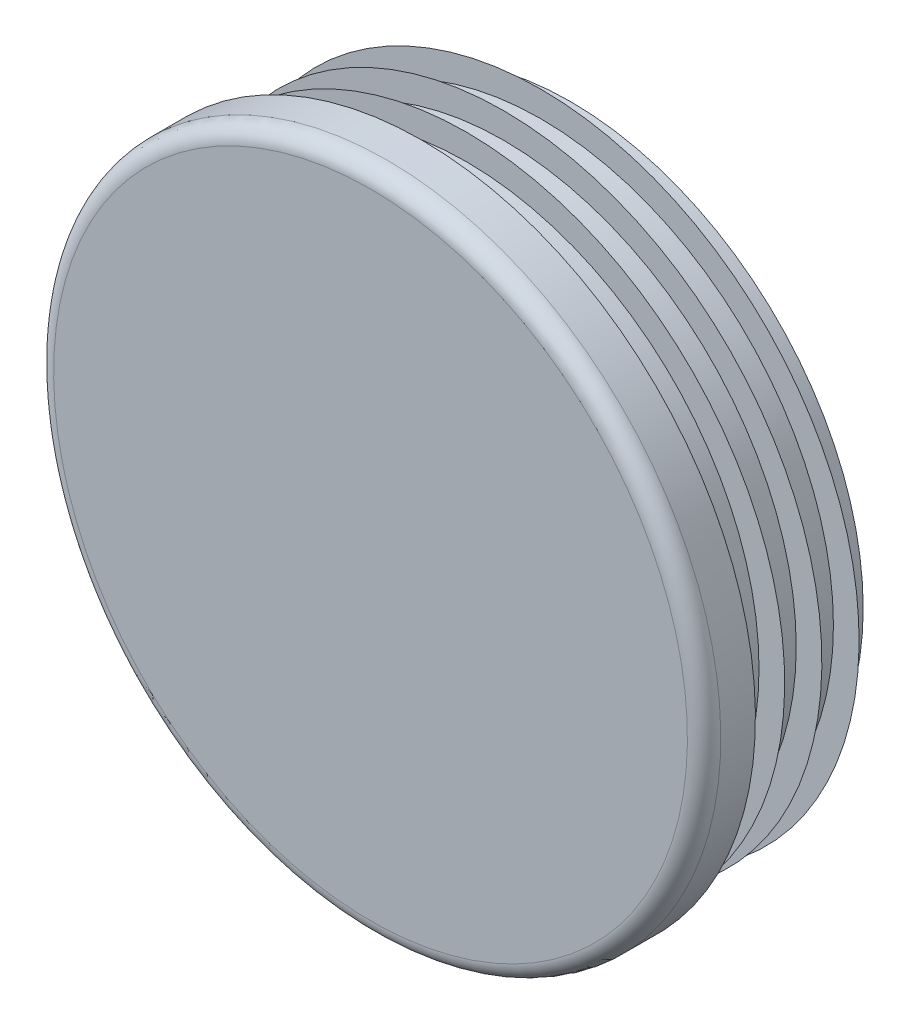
ISO-10303-21;
HEADER;
FILE_DESCRIPTION(('STEP AP214'),'2;1');
FILE_NAME('part.step','',(''),(''),'','','');
FILE_SCHEMA(('AUTOMOTIVE_DESIGN { 1 0 10303 214 1 1 1 1 }'));
ENDSEC;
DATA;
#1=APPLICATION_CONTEXT('core data for automotive mechanical design processes');
#2=APPLICATION_PROTOCOL_DEFINITION('international standard','automotive_design',2000,#1);
#3=PRODUCT_CONTEXT('',#1,'mechanical');
#4=PRODUCT('Part','Part','',(#3));
#5=PRODUCT_RELATED_PRODUCT_CATEGORY('part','',(#4));
#6=PRODUCT_DEFINITION_FORMATION('','',#4);
#7=PRODUCT_DEFINITION_CONTEXT('part definition',#1,'design');
#8=PRODUCT_DEFINITION('design','',#6,#7);
#9=PRODUCT_DEFINITION_SHAPE('','',#8);
#10=(LENGTH_UNIT() NAMED_UNIT(*) SI_UNIT(.MILLI.,.METRE.));
#11=(NAMED_UNIT(*) PLANE_ANGLE_UNIT() SI_UNIT($,.RADIAN.));
#12=(NAMED_UNIT(*) SI_UNIT($,.STERADIAN.) SOLID_ANGLE_UNIT());
#13=UNCERTAINTY_MEASURE_WITH_UNIT(LENGTH_MEASURE(1.E-05),#10,'distance_accuracy_value','');
#14=(GEOMETRIC_REPRESENTATION_CONTEXT(3) GLOBAL_UNCERTAINTY_ASSIGNED_CONTEXT((#13)) GLOBAL_UNIT_ASSIGNED_CONTEXT((#10,
#11,#12)) REPRESENTATION_CONTEXT('',''));
#15=CARTESIAN_POINT('',(0.,0.,0.));
#16=DIRECTION('',(0.,0.,1.));
#17=DIRECTION('',(1.,0.,0.));
#18=AXIS2_PLACEMENT_3D('',#15,#16,#17);
#19=CARTESIAN_POINT('',(0.,0.,5.));
#20=DIRECTION('',(0.,0.,-1.));
#21=DIRECTION('',(0.,1.,0.));
#22=AXIS2_PLACEMENT_3D('',#19,#20,#21);
#23=PLANE('',#22);
#24=CARTESIAN_POINT('',(0.,0.,5.));
#25=DIRECTION('',(0.,0.,-1.));
#26=DIRECTION('',(0.,1.,0.));
#27=AXIS2_PLACEMENT_3D('',#24,#25,#26);
#28=CIRCLE('',#27,30.875);
#29=CARTESIAN_POINT('',(0.,30.875,5.));
#30=VERTEX_POINT('',#29);
#31=EDGE_CURVE('E8',#30,#30,#28,.T.);
#32=ORIENTED_EDGE('',*,*,#31,.F.);
#33=EDGE_LOOP('',(#32));
#34=FACE_BOUND('',#33,.T.);
#35=ADVANCED_FACE('F12',(#34),#23,.F.);
#36=CARTESIAN_POINT('',(0.,0.,3.375));
#37=DIRECTION('',(0.,0.,-1.));
#38=DIRECTION('',(0.,1.,0.));
#39=AXIS2_PLACEMENT_3D('',#36,#37,#38);
#40=TOROIDAL_SURFACE('',#39,30.875,1.625);
#41=ORIENTED_EDGE('',*,*,#31,.T.);
#42=EDGE_LOOP('',(#41));
#43=FACE_BOUND('',#42,.T.);
#44=CARTESIAN_POINT('',(0.,0.,3.375));
#45=DIRECTION('',(0.,0.,-1.));
#46=DIRECTION('',(0.,1.,0.));
#47=AXIS2_PLACEMENT_3D('',#44,#45,#46);
#48=CIRCLE('',#47,32.5);
#49=CARTESIAN_POINT('',(0.,32.5,3.375));
#50=VERTEX_POINT('',#49);
#51=EDGE_CURVE('E18',#50,#50,#48,.T.);
#52=ORIENTED_EDGE('',*,*,#51,.F.);
#53=EDGE_LOOP('',(#52));
#54=FACE_BOUND('',#53,.T.);
#55=ADVANCED_FACE('F159',(#43,#54),#40,.T.);
#56=CARTESIAN_POINT('',(0.,0.,-14.5));
#57=DIRECTION('',(0.,0.,-1.));
#58=DIRECTION('',(0.,1.,0.));
#59=AXIS2_PLACEMENT_3D('',#56,#57,#58);
#60=CYLINDRICAL_SURFACE('',#59,32.5);
#61=CARTESIAN_POINT('',(0.,0.,0.));
#62=DIRECTION('',(0.,0.,-1.));
#63=DIRECTION('',(0.,1.,0.));
#64=AXIS2_PLACEMENT_3D('',#61,#62,#63);
#65=CIRCLE('',#64,32.5);
#66=CARTESIAN_POINT('',(0.,32.5,0.));
#67=VERTEX_POINT('',#66);
#68=EDGE_CURVE('E22',#67,#67,#65,.T.);
#69=ORIENTED_EDGE('',*,*,#68,.F.);
#70=EDGE_LOOP('',(#69));
#71=FACE_BOUND('',#70,.T.);
#72=ORIENTED_EDGE('',*,*,#51,.T.);
#73=EDGE_LOOP('',(#72));
#74=FACE_BOUND('',#73,.T.);
#75=ADVANCED_FACE('F154',(#71,#74),#60,.T.);
#76=CARTESIAN_POINT('',(32.5,0.,0.));
#77=DIRECTION('',(0.,0.,1.));
#78=DIRECTION('',(0.,-1.,0.));
#79=AXIS2_PLACEMENT_3D('',#76,#77,#78);
#80=PLANE('',#79);
#81=CARTESIAN_POINT('',(0.,0.,0.));
#82=DIRECTION('',(0.,0.,-1.));
#83=DIRECTION('',(0.,1.,0.));
#84=AXIS2_PLACEMENT_3D('',#81,#82,#83);
#85=CIRCLE('',#84,28.5);
#86=CARTESIAN_POINT('',(0.,28.5,0.));
#87=VERTEX_POINT('',#86);
#88=EDGE_CURVE('E26',#87,#87,#85,.T.);
#89=ORIENTED_EDGE('',*,*,#88,.F.);
#90=EDGE_LOOP('',(#89));
#91=FACE_BOUND('',#90,.T.);
#92=ORIENTED_EDGE('',*,*,#68,.T.);
#93=EDGE_LOOP('',(#92));
#94=FACE_BOUND('',#93,.T.);
#95=ADVANCED_FACE('F148',(#91,#94),#80,.F.);
#96=CARTESIAN_POINT('',(0.,0.,-14.5));
#97=DIRECTION('',(0.,0.,-1.));
#98=DIRECTION('',(0.,1.,0.));
#99=AXIS2_PLACEMENT_3D('',#96,#97,#98);
#100=CYLINDRICAL_SURFACE('',#99,28.5);
#101=CARTESIAN_POINT('',(0.,0.,-0.725));
#102=DIRECTION('',(0.,0.,-1.));
#103=DIRECTION('',(0.,1.,0.));
#104=AXIS2_PLACEMENT_3D('',#101,#102,#103);
#105=CIRCLE('',#104,28.5);
#106=CARTESIAN_POINT('',(0.,28.5,-0.725));
#107=VERTEX_POINT('',#106);
#108=EDGE_CURVE('E31',#107,#107,#105,.T.);
#109=ORIENTED_EDGE('',*,*,#108,.F.);
#110=EDGE_LOOP('',(#109));
#111=FACE_BOUND('',#110,.T.);
#112=ORIENTED_EDGE('',*,*,#88,.T.);
#113=EDGE_LOOP('',(#112));
#114=FACE_BOUND('',#113,.T.);
#115=ADVANCED_FACE('F142',(#111,#114),#100,.T.);
#116=CARTESIAN_POINT('',(28.5,0.,-0.725));
#117=DIRECTION('',(0.,0.,-1.));
#118=DIRECTION('',(0.,1.,0.));
#119=AXIS2_PLACEMENT_3D('',#116,#117,#118);
#120=PLANE('',#119);
#121=CARTESIAN_POINT('',(0.,0.,-0.725));
#122=DIRECTION('',(0.,0.,-1.));
#123=DIRECTION('',(0.,1.,0.));
#124=AXIS2_PLACEMENT_3D('',#121,#122,#123);
#125=CIRCLE('',#124,31.);
#126=CARTESIAN_POINT('',(0.,31.,-0.725));
#127=VERTEX_POINT('',#126);
#128=EDGE_CURVE('E34',#127,#127,#125,.T.);
#129=ORIENTED_EDGE('',*,*,#128,.F.);
#130=EDGE_LOOP('',(#129));
#131=FACE_BOUND('',#130,.T.);
#132=ORIENTED_EDGE('',*,*,#108,.T.);
#133=EDGE_LOOP('',(#132));
#134=FACE_BOUND('',#133,.T.);
#135=ADVANCED_FACE('F136',(#131,#134),#120,.F.);
#136=CARTESIAN_POINT('',(0.,0.,-0.725));
#137=DIRECTION('',(0.,0.,1.));
#138=DIRECTION('',(0.,-1.,0.));
#139=AXIS2_PLACEMENT_3D('',#136,#137,#138);
#140=CONICAL_SURFACE('',#139,31.,0.959931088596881);
#141=CARTESIAN_POINT('',(0.,0.,-2.47551884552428));
#142=DIRECTION('',(0.,0.,-1.));
#143=DIRECTION('',(0.,1.,0.));
#144=AXIS2_PLACEMENT_3D('',#141,#142,#143);
#145=CIRCLE('',#144,28.5);
#146=CARTESIAN_POINT('',(0.,28.5,-2.47551884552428));
#147=VERTEX_POINT('',#146);
#148=EDGE_CURVE('E37',#147,#147,#145,.T.);
#149=ORIENTED_EDGE('',*,*,#148,.F.);
#150=EDGE_LOOP('',(#149));
#151=FACE_BOUND('',#150,.T.);
#152=ORIENTED_EDGE('',*,*,#128,.T.);
#153=EDGE_LOOP('',(#152));
#154=FACE_BOUND('',#153,.T.);
#155=ADVANCED_FACE('F130',(#151,#154),#140,.T.);
#156=CARTESIAN_POINT('',(0.,0.,-14.5));
#157=DIRECTION('',(0.,0.,-1.));
#158=DIRECTION('',(0.,1.,0.));
#159=AXIS2_PLACEMENT_3D('',#156,#157,#158);
#160=CYLINDRICAL_SURFACE('',#159,28.5);
#161=CARTESIAN_POINT('',(0.,0.,-4.35));
#162=DIRECTION('',(0.,0.,-1.));
#163=DIRECTION('',(0.,1.,0.));
#164=AXIS2_PLACEMENT_3D('',#161,#162,#163);
#165=CIRCLE('',#164,28.5);
#166=CARTESIAN_POINT('',(0.,28.5,-4.35));
#167=VERTEX_POINT('',#166);
#168=EDGE_CURVE('E40',#167,#167,#165,.T.);
#169=ORIENTED_EDGE('',*,*,#168,.F.);
#170=EDGE_LOOP('',(#169));
#171=FACE_BOUND('',#170,.T.);
#172=ORIENTED_EDGE('',*,*,#148,.T.);
#173=EDGE_LOOP('',(#172));
#174=FACE_BOUND('',#173,.T.);
#175=ADVANCED_FACE('F124',(#171,#174),#160,.T.);
#176=CARTESIAN_POINT('',(28.5,0.,-4.35));
#177=DIRECTION('',(0.,0.,-1.));
#178=DIRECTION('',(0.,1.,0.));
#179=AXIS2_PLACEMENT_3D('',#176,#177,#178);
#180=PLANE('',#179);
#181=CARTESIAN_POINT('',(0.,0.,-4.35));
#182=DIRECTION('',(0.,0.,-1.));
#183=DIRECTION('',(0.,1.,0.));
#184=AXIS2_PLACEMENT_3D('',#181,#182,#183);
#185=CIRCLE('',#184,31.);
#186=CARTESIAN_POINT('',(0.,31.,-4.35));
#187=VERTEX_POINT('',#186);
#188=EDGE_CURVE('E43',#187,#187,#185,.T.);
#189=ORIENTED_EDGE('',*,*,#188,.F.);
#190=EDGE_LOOP('',(#189));
#191=FACE_BOUND('',#190,.T.);
#192=ORIENTED_EDGE('',*,*,#168,.T.);
#193=EDGE_LOOP('',(#192));
#194=FACE_BOUND('',#193,.T.);
#195=ADVANCED_FACE('F118',(#191,#194),#180,.F.);
#196=CARTESIAN_POINT('',(0.,0.,-4.35));
#197=DIRECTION('',(0.,0.,1.));
#198=DIRECTION('',(0.,-1.,0.));
#199=AXIS2_PLACEMENT_3D('',#196,#197,#198);
#200=CONICAL_SURFACE('',#199,31.,0.959931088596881);
#201=CARTESIAN_POINT('',(0.,0.,-6.10051884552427));
#202=DIRECTION('',(0.,0.,-1.));
#203=DIRECTION('',(0.,1.,0.));
#204=AXIS2_PLACEMENT_3D('',#201,#202,#203);
#205=CIRCLE('',#204,28.5);
#206=CARTESIAN_POINT('',(0.,28.5,-6.10051884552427));
#207=VERTEX_POINT('',#206);
#208=EDGE_CURVE('E46',#207,#207,#205,.T.);
#209=ORIENTED_EDGE('',*,*,#208,.F.);
#210=EDGE_LOOP('',(#209));
#211=FACE_BOUND('',#210,.T.);
#212=ORIENTED_EDGE('',*,*,#188,.T.);
#213=EDGE_LOOP('',(#212));
#214=FACE_BOUND('',#213,.T.);
#215=ADVANCED_FACE('F112',(#211,#214),#200,.T.);
#216=CARTESIAN_POINT('',(0.,0.,-14.5));
#217=DIRECTION('',(0.,0.,-1.));
#218=DIRECTION('',(0.,1.,0.));
#219=AXIS2_PLACEMENT_3D('',#216,#217,#218);
#220=CYLINDRICAL_SURFACE('',#219,28.5);
#221=CARTESIAN_POINT('',(0.,0.,-7.975));
#222=DIRECTION('',(0.,0.,-1.));
#223=DIRECTION('',(0.,1.,0.));
#224=AXIS2_PLACEMENT_3D('',#221,#222,#223);
#225=CIRCLE('',#224,28.5);
#226=CARTESIAN_POINT('',(0.,28.5,-7.975));
#227=VERTEX_POINT('',#226);
#228=EDGE_CURVE('E49',#227,#227,#225,.T.);
#229=ORIENTED_EDGE('',*,*,#228,.F.);
#230=EDGE_LOOP('',(#229));
#231=FACE_BOUND('',#230,.T.);
#232=ORIENTED_EDGE('',*,*,#208,.T.);
#233=EDGE_LOOP('',(#232));
#234=FACE_BOUND('',#233,.T.);
#235=ADVANCED_FACE('F106',(#231,#234),#220,.T.);
#236=CARTESIAN_POINT('',(28.5,0.,-7.975));
#237=DIRECTION('',(0.,0.,-1.));
#238=DIRECTION('',(0.,1.,0.));
#239=AXIS2_PLACEMENT_3D('',#236,#237,#238);
#240=PLANE('',#239);
#241=CARTESIAN_POINT('',(0.,0.,-7.975));
#242=DIRECTION('',(0.,0.,-1.));
#243=DIRECTION('',(0.,1.,0.));
#244=AXIS2_PLACEMENT_3D('',#241,#242,#243);
#245=CIRCLE('',#244,31.);
#246=CARTESIAN_POINT('',(0.,31.,-7.975));
#247=VERTEX_POINT('',#246);
#248=EDGE_CURVE('E52',#247,#247,#245,.T.);
#249=ORIENTED_EDGE('',*,*,#248,.F.);
#250=EDGE_LOOP('',(#249));
#251=FACE_BOUND('',#250,.T.);
#252=ORIENTED_EDGE('',*,*,#228,.T.);
#253=EDGE_LOOP('',(#252));
#254=FACE_BOUND('',#253,.T.);
#255=ADVANCED_FACE('F100',(#251,#254),#240,.F.);
#256=CARTESIAN_POINT('',(0.,0.,-7.975));
#257=DIRECTION('',(0.,0.,1.));
#258=DIRECTION('',(0.,-1.,0.));
#259=AXIS2_PLACEMENT_3D('',#256,#257,#258);
#260=CONICAL_SURFACE('',#259,31.,0.959931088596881);
#261=CARTESIAN_POINT('',(0.,0.,-9.72551884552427));
#262=DIRECTION('',(0.,0.,-1.));
#263=DIRECTION('',(0.,1.,0.));
#264=AXIS2_PLACEMENT_3D('',#261,#262,#263);
#265=CIRCLE('',#264,28.5);
#266=CARTESIAN_POINT('',(0.,28.5,-9.72551884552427));
#267=VERTEX_POINT('',#266);
#268=EDGE_CURVE('E55',#267,#267,#265,.T.);
#269=ORIENTED_EDGE('',*,*,#268,.F.);
#270=EDGE_LOOP('',(#269));
#271=FACE_BOUND('',#270,.T.);
#272=ORIENTED_EDGE('',*,*,#248,.T.);
#273=EDGE_LOOP('',(#272));
#274=FACE_BOUND('',#273,.T.);
#275=ADVANCED_FACE('F94',(#271,#274),#260,.T.);
#276=CARTESIAN_POINT('',(0.,0.,-14.5));
#277=DIRECTION('',(0.,0.,-1.));
#278=DIRECTION('',(0.,1.,0.));
#279=AXIS2_PLACEMENT_3D('',#276,#277,#278);
#280=CYLINDRICAL_SURFACE('',#279,28.5);
#281=CARTESIAN_POINT('',(0.,0.,-11.6));
#282=DIRECTION('',(0.,0.,-1.));
#283=DIRECTION('',(0.,1.,0.));
#284=AXIS2_PLACEMENT_3D('',#281,#282,#283);
#285=CIRCLE('',#284,28.5);
#286=CARTESIAN_POINT('',(0.,28.5,-11.6));
#287=VERTEX_POINT('',#286);
#288=EDGE_CURVE('E58',#287,#287,#285,.T.);
#289=ORIENTED_EDGE('',*,*,#288,.F.);
#290=EDGE_LOOP('',(#289));
#291=FACE_BOUND('',#290,.T.);
#292=ORIENTED_EDGE('',*,*,#268,.T.);
#293=EDGE_LOOP('',(#292));
#294=FACE_BOUND('',#293,.T.);
#295=ADVANCED_FACE('F88',(#291,#294),#280,.T.);
#296=CARTESIAN_POINT('',(28.5,0.,-11.6));
#297=DIRECTION('',(0.,0.,-1.));
#298=DIRECTION('',(0.,1.,0.));
#299=AXIS2_PLACEMENT_3D('',#296,#297,#298);
#300=PLANE('',#299);
#301=CARTESIAN_POINT('',(0.,0.,-11.6));
#302=DIRECTION('',(0.,0.,-1.));
#303=DIRECTION('',(0.,1.,0.));
#304=AXIS2_PLACEMENT_3D('',#301,#302,#303);
#305=CIRCLE('',#304,31.);
#306=CARTESIAN_POINT('',(0.,31.,-11.6));
#307=VERTEX_POINT('',#306);
#308=EDGE_CURVE('E61',#307,#307,#305,.T.);
#309=ORIENTED_EDGE('',*,*,#308,.F.);
#310=EDGE_LOOP('',(#309));
#311=FACE_BOUND('',#310,.T.);
#312=ORIENTED_EDGE('',*,*,#288,.T.);
#313=EDGE_LOOP('',(#312));
#314=FACE_BOUND('',#313,.T.);
#315=ADVANCED_FACE('F82',(#311,#314),#300,.F.);
#316=CARTESIAN_POINT('',(0.,0.,-11.6));
#317=DIRECTION('',(0.,0.,1.));
#318=DIRECTION('',(0.,-1.,0.));
#319=AXIS2_PLACEMENT_3D('',#316,#317,#318);
#320=CONICAL_SURFACE('',#319,31.,0.959931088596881);
#321=CARTESIAN_POINT('',(0.,0.,-13.3505188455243));
#322=DIRECTION('',(0.,0.,-1.));
#323=DIRECTION('',(0.,1.,0.));
#324=AXIS2_PLACEMENT_3D('',#321,#322,#323);
#325=CIRCLE('',#324,28.5);
#326=CARTESIAN_POINT('',(0.,28.5,-13.3505188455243));
#327=VERTEX_POINT('',#326);
#328=EDGE_CURVE('E64',#327,#327,#325,.T.);
#329=ORIENTED_EDGE('',*,*,#328,.F.);
#330=EDGE_LOOP('',(#329));
#331=FACE_BOUND('',#330,.T.);
#332=ORIENTED_EDGE('',*,*,#308,.T.);
#333=EDGE_LOOP('',(#332));
#334=FACE_BOUND('',#333,.T.);
#335=ADVANCED_FACE('F76',(#331,#334),#320,.T.);
#336=CARTESIAN_POINT('',(0.,0.,-14.5));
#337=DIRECTION('',(0.,0.,-1.));
#338=DIRECTION('',(0.,1.,0.));
#339=AXIS2_PLACEMENT_3D('',#336,#337,#338);
#340=CYLINDRICAL_SURFACE('',#339,28.5);
#341=CARTESIAN_POINT('',(0.,0.,-14.5));
#342=DIRECTION('',(0.,0.,-1.));
#343=DIRECTION('',(0.,1.,0.));
#344=AXIS2_PLACEMENT_3D('',#341,#342,#343);
#345=CIRCLE('',#344,28.5);
#346=CARTESIAN_POINT('',(0.,28.5,-14.5));
#347=VERTEX_POINT('',#346);
#348=EDGE_CURVE('E67',#347,#347,#345,.T.);
#349=ORIENTED_EDGE('',*,*,#348,.F.);
#350=EDGE_LOOP('',(#349));
#351=FACE_BOUND('',#350,.T.);
#352=ORIENTED_EDGE('',*,*,#328,.T.);
#353=EDGE_LOOP('',(#352));
#354=FACE_BOUND('',#353,.T.);
#355=ADVANCED_FACE('F73',(#351,#354),#340,.T.);
#356=CARTESIAN_POINT('',(28.5,0.,-14.5));
#357=DIRECTION('',(0.,0.,1.));
#358=DIRECTION('',(0.,-1.,0.));
#359=AXIS2_PLACEMENT_3D('',#356,#357,#358);
#360=PLANE('',#359);
#361=ORIENTED_EDGE('',*,*,#348,.T.);
#362=EDGE_LOOP('',(#361));
#363=FACE_BOUND('',#362,.T.);
#364=ADVANCED_FACE('F71',(#363),#360,.F.);
#365=CLOSED_SHELL('',(#35,#55,#75,#95,#115,#135,#155,#175,#195,#215,#235,#255,#275,#295,#315,
#335,#355,#364));
#366=MANIFOLD_SOLID_BREP('B1',#365);
#367=ADVANCED_BREP_SHAPE_REPRESENTATION('',(#18,#366),#14);
#368=SHAPE_DEFINITION_REPRESENTATION(#9,#367);
ENDSEC;
END-ISO-10303-21;
